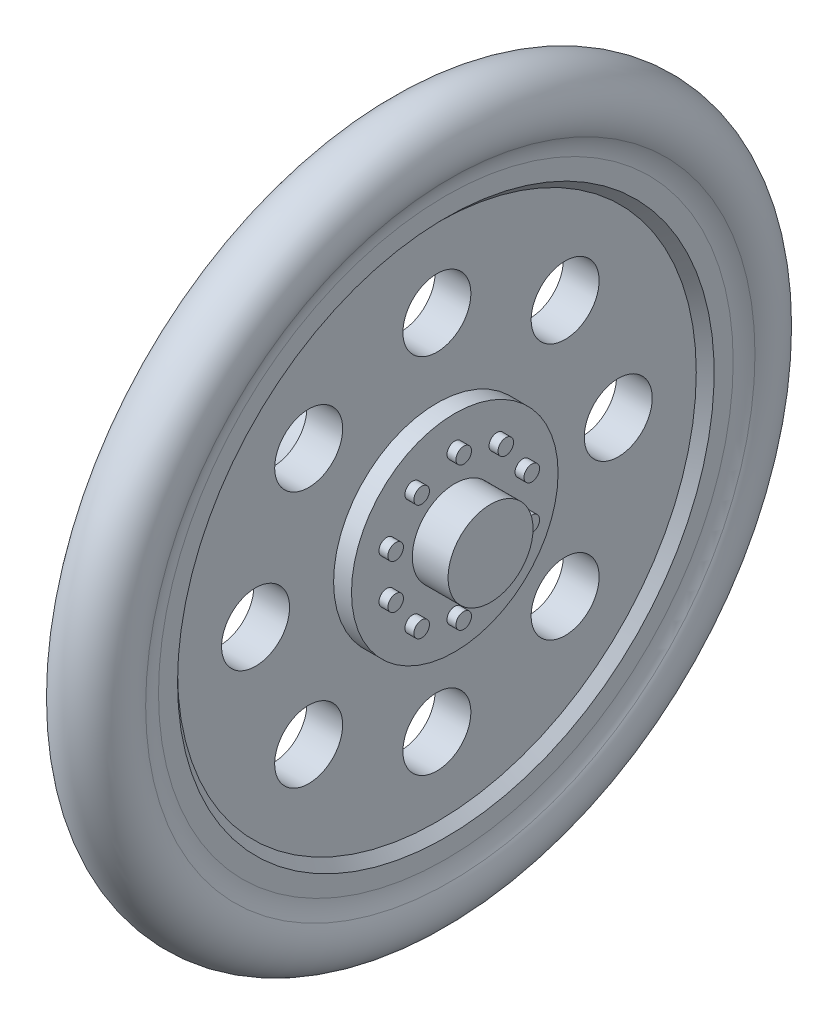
from build123d import *

# Parameters (mm, degrees)
FILLET1_R          = 2
SKETCH2_R          = 5.775
EXTRUDE1_DEPTH     = 1
SKETCH3_R          = 2.375
EXTRUDE2_DEPTH     = 2
SKETCH4_R          = 0.435
EXTRUDE3_DEPTH     = 0.5
CIRPATTERN1_COUNT  = 10
SKETCH5_R          = 1.9
CUT_EXTRUDE1_DEPTH = 30.83705763
CIRPATTERN2_COUNT  = 8
SKETCH6_R          = 1.63
CUT_EXTRUDE2_DEPTH = 10.9125


with BuildPart() as part:
    # Sketch1 → Revolve1 (revolve)
    with BuildSketch(Plane.XY, mode=Mode.PRIVATE) as revolve1_sk:
        with BuildLine():
            Line((9.5, 0), (0, 0))
            Line((0, 0), (0, 3.1))
            Line((0, 3.1), (7.5, 3.1))
            Line((7.5, 3.1), (7.5, 14.5))
            Line((7.5, 14.5), (7, 15))
            Line((7, 15), (7, 16.677124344))
            ThreePointArc((7, 16.677124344), (8.5, 20), (10, 16.677124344))
            Line((10, 16.677124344), (10, 15))
            Line((10, 15), (9.5, 14.5))
            Line((9.5, 14.5), (9.5, 0))
        make_face()
    revolve(revolve1_sk.sketch.rotate(Axis((0, 0, 0), (1, 0, 0)), 90), axis=Axis((0, 0, 0), (1, 0, 0)))

    # Fillet1
    fillet1_edges = [part.edges().sort_by_distance(p)[0] for p in [
        (7, 0, -16.677124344),
        (10, 0, -16.677124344),
    ]]
    fillet(fillet1_edges, radius=FILLET1_R)

    # Sketch2 → Extrude1 (add)
    with BuildSketch(Plane(origin=(9.5, 0, 0), x_dir=(0, 0, -1), z_dir=(1, 0, 0))):
        with Locations(Location((0, 0, 0), (0, 0, 180))):
            Circle(SKETCH2_R)
    extrude(amount=EXTRUDE1_DEPTH)

    # Sketch3 → Extrude2 (add)
    with BuildSketch(Plane(origin=(10.5, 0, 0), x_dir=(0, 0, -1), z_dir=(1, 0, 0))):
        Circle(SKETCH3_R)
    extrude(amount=EXTRUDE2_DEPTH)

    # Sketch4 → Extrude3 (add)
    with BuildSketch(Plane(origin=(10.5, 0, 0), x_dir=(0, 0, -1), z_dir=(1, 0, 0))):
        with Locations((0, 4)):
            Circle(SKETCH4_R)
    extrude3 = extrude(amount=EXTRUDE3_DEPTH)

    # CirPattern1: Extrude3 ×10 about axis
    cirpattern1_axis = Axis((0, 0, 0), (1, 0, 0))
    for i in range(1, CIRPATTERN1_COUNT):
        add(extrude3.rotate(cirpattern1_axis, i * 360 / CIRPATTERN1_COUNT))

    # Sketch5 → Cut-Extrude1 (cut, through all)
    with BuildSketch(Plane(origin=(9.5, 0, 0), x_dir=(0, 0, -1), z_dir=(1, 0, 0))):
        with Locations((0, 10.1375)):
            Circle(SKETCH5_R)
    cut_extrude1 = extrude(amount=-CUT_EXTRUDE1_DEPTH, mode=Mode.SUBTRACT)

    # CirPattern2: Cut-Extrude1 ×8 about axis
    cirpattern2_axis = Axis((0, 0, 0), (1, 0, 0))
    for i in range(1, CIRPATTERN2_COUNT):
        add(cut_extrude1.rotate(cirpattern2_axis, i * 360 / CIRPATTERN2_COUNT), mode=Mode.SUBTRACT)

    # Sketch6 → Cut-Extrude2 (cut)
    with BuildSketch(Plane.ZY):
        Circle(SKETCH6_R)
    extrude(amount=-CUT_EXTRUDE2_DEPTH, mode=Mode.SUBTRACT)


solid = part.part
